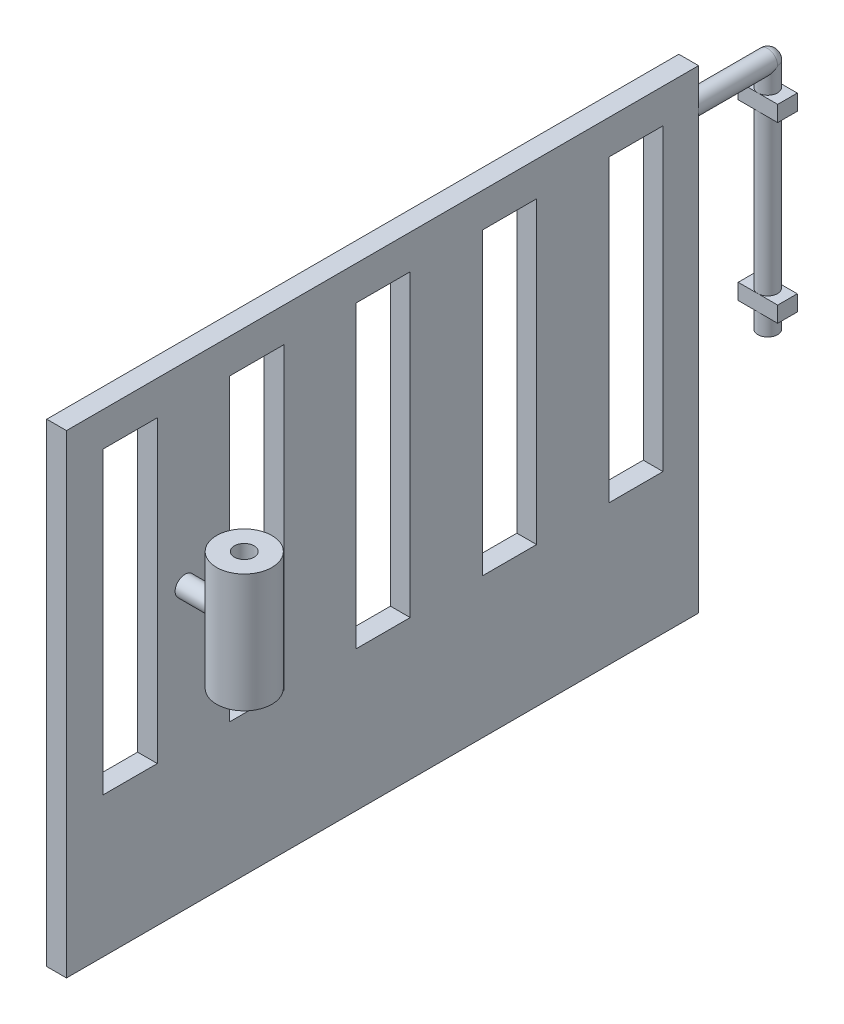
from build123d import *

# Parameters (mm, degrees)
ESQUISSE1_W             = 5
ESQUISSE1_H             = 120
BASE_EXTRUSION_DEPTH    = 160
ESQUISSE2_R             = 2.5
BOSS_EXTRU_1_DEPTH      = 20
BOSS_R_VOL_1_ANGLE      = 90
ESQUISSE4_R             = 2.479213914
BOSS_EXTRU_2_DEPTH      = 10
ESQUISSE5_W             = 10
ESQUISSE5_H             = 4.958427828
BOSS_EXTRU_3_DEPTH      = 4
BOSS_EXTRU_4_DEPTH      = 40
ESQUISSE8_W             = 10
ESQUISSE8_H             = 4.958427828
BOSS_EXTRU_5_DEPTH      = 4
BOSS_EXTRU_6_DEPTH      = 5
ESQUISSE10_R            = 2.5
BOSS_EXTRU_7_DEPTH      = 15
BOSS_EXTRU_8_DEPTH      = 15
BOSS_EXTRU_8_DEPTH_BACK = 15
ESQUISSE11_R            = 7
ESQUISSE12_R            = 2.5
ENL_V_MAT_EXTRU_1_DEPTH = 44
ESQUISSE13_W            = 13.726497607
ESQUISSE13_H            = 75.807702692
ENL_V_MAT_EXTRU_2_DEPTH = 8


with BuildPart() as part:
    # Esquisse1 → Base-Extrusion (new body)
    with BuildSketch(Plane.XY):
        with Locations((2.5, 60)):
            Rectangle(ESQUISSE1_W, ESQUISSE1_H)
    extrude(amount=BASE_EXTRUSION_DEPTH)

    # Esquisse2 → Boss.-Extru.1 (add)
    with BuildSketch(Plane(origin=(0, 0, 0), x_dir=(-1, 0, 0), z_dir=(0, 0, -1))):
        with Locations((-2.5, 110)):
            Circle(ESQUISSE2_R)
    extrude(amount=BOSS_EXTRU_1_DEPTH)

    # Esquisse3 → Boss.-R_vol.1 (revolve)
    with BuildSketch(Plane(origin=(0, 0, -20), x_dir=(-1, 0, 0), z_dir=(0, 0, -1))):
        with BuildLine():
            Line((-5, 110), (0, 110))
            ThreePointArc((0, 110), (-2.5, 112.5), (-5, 110))
        make_face()
    revolve(axis=Axis((15.625959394, 110, -20), (-1, 0, 0)), revolution_arc=BOSS_R_VOL_1_ANGLE)

    # Esquisse4 → Boss.-Extru.2 (add)
    with BuildSketch(Plane.XZ.offset(-110)):
        with Locations(Location((2.5, -20, 0), (0, 0, 179.999999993))):
            Circle(ESQUISSE4_R)
    extrude(amount=BOSS_EXTRU_2_DEPTH)

    # Esquisse5 → Boss.-Extru.3 (add)
    with BuildSketch(Plane.XZ.offset(-100)):
        with Locations((2.5, -20)):
            Rectangle(ESQUISSE5_W, ESQUISSE5_H)
    extrude(amount=-BOSS_EXTRU_3_DEPTH)

    # Esquisse7 → Boss.-Extru.4 (add)
    with BuildSketch(Plane.XZ.offset(-100)):
        with BuildLine():
            ThreePointArc((2.5, -17.520786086), (0.020786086, -20), (2.5, -22.479213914))
            ThreePointArc((2.5, -22.479213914), (4.979213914, -20), (2.5, -17.520786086))
        make_face()
    extrude(amount=BOSS_EXTRU_4_DEPTH)

    # Esquisse8 → Boss.-Extru.5 (add)
    with BuildSketch(Plane.XZ.offset(-60)):
        with Locations((2.5, -20)):
            Rectangle(ESQUISSE8_W, ESQUISSE8_H)
    extrude(amount=BOSS_EXTRU_5_DEPTH)

    # Esquisse9 → Boss.-Extru.6 (add)
    with BuildSketch(Plane.XZ.offset(-56)):
        with BuildLine():
            ThreePointArc((2.5, -22.479213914), (4.979213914, -20), (2.5, -17.520786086))
            ThreePointArc((2.5, -17.520786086), (0.020786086, -20), (2.5, -22.479213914))
        make_face()
    extrude(amount=BOSS_EXTRU_6_DEPTH)

    # Esquisse10 → Boss.-Extru.7 (add)
    with BuildSketch(Plane(origin=(5, 0, 0), x_dir=(0, 0, -1), z_dir=(1, 0, 0))):
        with Locations(Location((-130, 71, 0), (0, 0, 270))):
            Circle(ESQUISSE10_R)
    extrude(amount=BOSS_EXTRU_7_DEPTH)

    # Esquisse11 → Boss.-Extru.8 (add, two sides: drawn at the far end of the back side and taken through both)
    with BuildSketch(Plane(origin=(0, 71, 0), x_dir=(-1, 0, 0), z_dir=(0, 1, 0)).offset(-BOSS_EXTRU_8_DEPTH_BACK)):
        with Locations(Location((-20, 130, 0), (0, 0, 90))):
            Circle(ESQUISSE11_R)
    extrude(amount=BOSS_EXTRU_8_DEPTH + BOSS_EXTRU_8_DEPTH_BACK)

    # Esquisse12 → Enl_v. mat.-Extru.1 (cut)
    with BuildSketch(Plane(origin=(0, 86, 0), x_dir=(-1, 0, 0), z_dir=(0, 1, 0))):
        with Locations(Location((-20, 130, 0), (0, 0, 90))):
            Circle(ESQUISSE12_R)
    extrude(amount=-ENL_V_MAT_EXTRU_1_DEPTH, mode=Mode.SUBTRACT)

    # Esquisse13 → Enl_v. mat.-Extru.2 (cut)
    with BuildSketch(Plane.ZY):
        with Locations((47.863248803, 73.414531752)):
            Rectangle(ESQUISSE13_W, ESQUISSE13_H)
        with Locations((15.863248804, 73.414531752)):
            Rectangle(ESQUISSE13_W, ESQUISSE13_H)
        with Locations((79.863248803, 73.414531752)):
            Rectangle(ESQUISSE13_W, ESQUISSE13_H)
        with Locations((111.863248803, 73.414531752)):
            Rectangle(ESQUISSE13_W, ESQUISSE13_H)
        with Locations((143.863248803, 73.414531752)):
            Rectangle(ESQUISSE13_W, ESQUISSE13_H)
    extrude(amount=-ENL_V_MAT_EXTRU_2_DEPTH, mode=Mode.SUBTRACT)


solid = part.part
